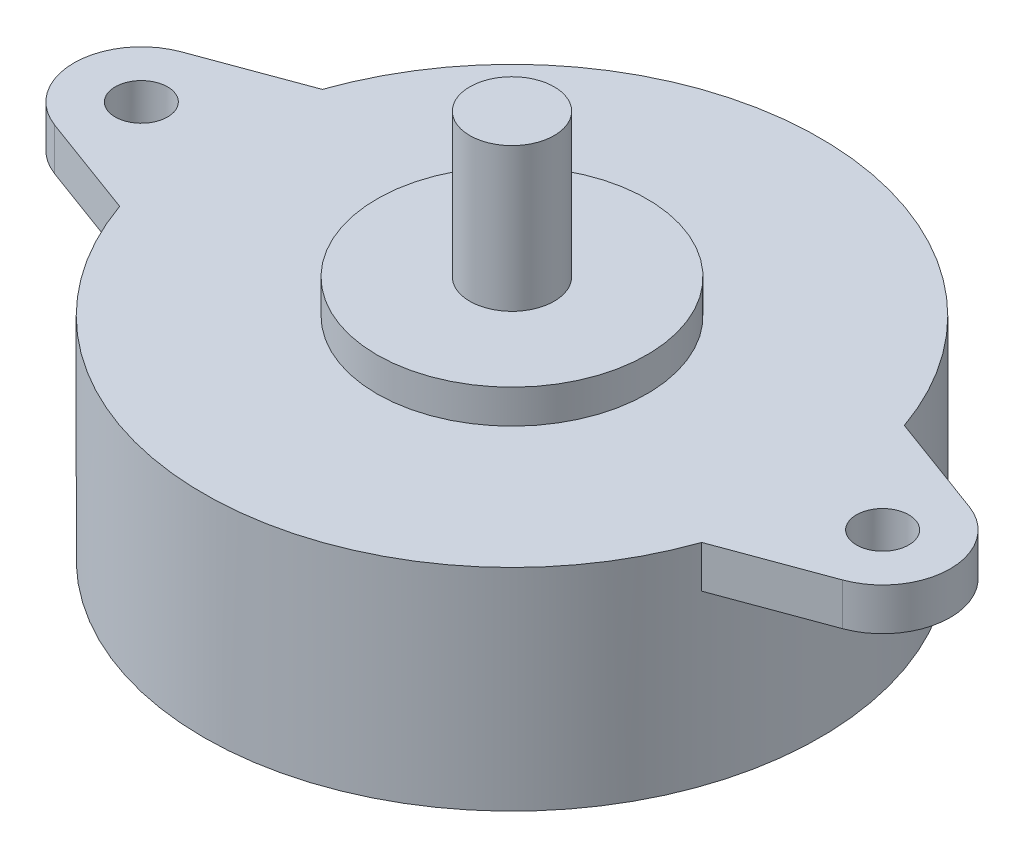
ISO-10303-21;
HEADER;
FILE_DESCRIPTION(('STEP AP214'),'2;1');
FILE_NAME('part.step','',(''),(''),'','','');
FILE_SCHEMA(('AUTOMOTIVE_DESIGN { 1 0 10303 214 1 1 1 1 }'));
ENDSEC;
DATA;
#1=APPLICATION_CONTEXT('core data for automotive mechanical design processes');
#2=APPLICATION_PROTOCOL_DEFINITION('international standard','automotive_design',2000,#1);
#3=PRODUCT_CONTEXT('',#1,'mechanical');
#4=PRODUCT('Part','Part','',(#3));
#5=PRODUCT_RELATED_PRODUCT_CATEGORY('part','',(#4));
#6=PRODUCT_DEFINITION_FORMATION('','',#4);
#7=PRODUCT_DEFINITION_CONTEXT('part definition',#1,'design');
#8=PRODUCT_DEFINITION('design','',#6,#7);
#9=PRODUCT_DEFINITION_SHAPE('','',#8);
#10=(LENGTH_UNIT() NAMED_UNIT(*) SI_UNIT(.MILLI.,.METRE.));
#11=(NAMED_UNIT(*) PLANE_ANGLE_UNIT() SI_UNIT($,.RADIAN.));
#12=(NAMED_UNIT(*) SI_UNIT($,.STERADIAN.) SOLID_ANGLE_UNIT());
#13=UNCERTAINTY_MEASURE_WITH_UNIT(LENGTH_MEASURE(1.E-05),#10,'distance_accuracy_value','');
#14=(GEOMETRIC_REPRESENTATION_CONTEXT(3) GLOBAL_UNCERTAINTY_ASSIGNED_CONTEXT((#13)) GLOBAL_UNIT_ASSIGNED_CONTEXT((#10,
#11,#12)) REPRESENTATION_CONTEXT('',''));
#15=CARTESIAN_POINT('',(0.,0.,0.));
#16=DIRECTION('',(0.,0.,1.));
#17=DIRECTION('',(1.,0.,0.));
#18=AXIS2_PLACEMENT_3D('',#15,#16,#17);
#19=CARTESIAN_POINT('',(-21.95,12.5,0.));
#20=DIRECTION('',(0.,-1.,0.));
#21=DIRECTION('',(0.,0.,-1.));
#22=AXIS2_PLACEMENT_3D('',#19,#20,#21);
#23=CYLINDRICAL_SURFACE('',#22,4.);
#24=CARTESIAN_POINT('',(-21.95,10.,0.));
#25=DIRECTION('',(0.,-1.,0.));
#26=DIRECTION('',(0.,0.,-1.));
#27=AXIS2_PLACEMENT_3D('',#24,#25,#26);
#28=CIRCLE('',#27,4.);
#29=CARTESIAN_POINT('',(-23.3329549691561,10.,3.75332326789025));
#30=VERTEX_POINT('',#29);
#31=CARTESIAN_POINT('',(-23.3329549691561,10.,-3.75332326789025));
#32=VERTEX_POINT('',#31);
#33=EDGE_CURVE('E108',#30,#32,#28,.T.);
#34=ORIENTED_EDGE('',*,*,#33,.F.);
#35=DIRECTION('',(0.,-1.,0.));
#36=VECTOR('',#35,1.);
#37=CARTESIAN_POINT('',(-23.3329549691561,12.5,3.75332326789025));
#38=LINE('',#37,#36);
#39=CARTESIAN_POINT('',(-23.3329549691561,12.5,3.75332326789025));
#40=VERTEX_POINT('',#39);
#41=EDGE_CURVE('E41',#40,#30,#38,.T.);
#42=ORIENTED_EDGE('',*,*,#41,.F.);
#43=CARTESIAN_POINT('',(-21.95,12.5,0.));
#44=DIRECTION('',(0.,1.,0.));
#45=DIRECTION('',(0.,0.,1.));
#46=AXIS2_PLACEMENT_3D('',#43,#44,#45);
#47=CIRCLE('',#46,4.);
#48=CARTESIAN_POINT('',(-23.3329549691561,12.5,-3.75332326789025));
#49=VERTEX_POINT('',#48);
#50=EDGE_CURVE('E172',#49,#40,#47,.T.);
#51=ORIENTED_EDGE('',*,*,#50,.F.);
#52=DIRECTION('',(0.,-1.,0.));
#53=VECTOR('',#52,1.);
#54=CARTESIAN_POINT('',(-23.3329549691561,12.5,-3.75332326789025));
#55=LINE('',#54,#53);
#56=EDGE_CURVE('E130',#49,#32,#55,.T.);
#57=ORIENTED_EDGE('',*,*,#56,.T.);
#58=EDGE_LOOP('',(#34,#42,#51,#57));
#59=FACE_BOUND('',#58,.T.);
#60=ADVANCED_FACE('F33',(#59),#23,.T.);
#61=CARTESIAN_POINT('',(-23.3329549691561,12.5,3.75332326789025));
#62=DIRECTION('',(0.345738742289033,0.,-0.938330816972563));
#63=DIRECTION('',(-0.938330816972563,0.,-0.345738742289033));
#64=AXIS2_PLACEMENT_3D('',#61,#62,#63);
#65=PLANE('',#64);
#66=DIRECTION('',(-0.938330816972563,0.,-0.345738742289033));
#67=VECTOR('',#66,1.);
#68=CARTESIAN_POINT('',(-23.3329549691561,10.,3.75332326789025));
#69=LINE('',#68,#67);
#70=CARTESIAN_POINT('',(-17.2355011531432,10.,6.));
#71=VERTEX_POINT('',#70);
#72=EDGE_CURVE('E120',#71,#30,#69,.T.);
#73=ORIENTED_EDGE('',*,*,#72,.F.);
#74=DIRECTION('',(0.,-1.,0.));
#75=VECTOR('',#74,1.);
#76=CARTESIAN_POINT('',(-17.2355011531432,12.5,6.));
#77=LINE('',#76,#75);
#78=CARTESIAN_POINT('',(-17.2355011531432,12.5,6.));
#79=VERTEX_POINT('',#78);
#80=EDGE_CURVE('E138',#79,#71,#77,.T.);
#81=ORIENTED_EDGE('',*,*,#80,.F.);
#82=DIRECTION('',(0.938330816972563,0.,0.345738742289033));
#83=VECTOR('',#82,1.);
#84=CARTESIAN_POINT('',(-23.3329549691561,12.5,3.75332326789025));
#85=LINE('',#84,#83);
#86=EDGE_CURVE('E174',#40,#79,#85,.T.);
#87=ORIENTED_EDGE('',*,*,#86,.F.);
#88=ORIENTED_EDGE('',*,*,#41,.T.);
#89=EDGE_LOOP('',(#73,#81,#87,#88));
#90=FACE_BOUND('',#89,.T.);
#91=ADVANCED_FACE('F201',(#90),#65,.F.);
#92=CARTESIAN_POINT('',(17.2355011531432,12.5,6.));
#93=DIRECTION('',(-0.345738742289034,0.,-0.938330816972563));
#94=DIRECTION('',(-0.938330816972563,0.,0.345738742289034));
#95=AXIS2_PLACEMENT_3D('',#92,#93,#94);
#96=PLANE('',#95);
#97=DIRECTION('',(-0.938330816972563,0.,0.345738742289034));
#98=VECTOR('',#97,1.);
#99=CARTESIAN_POINT('',(17.2355011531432,10.,6.));
#100=LINE('',#99,#98);
#101=CARTESIAN_POINT('',(23.3329549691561,10.,3.75332326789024));
#102=VERTEX_POINT('',#101);
#103=CARTESIAN_POINT('',(17.2355011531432,10.,6.));
#104=VERTEX_POINT('',#103);
#105=EDGE_CURVE('E103',#102,#104,#100,.T.);
#106=ORIENTED_EDGE('',*,*,#105,.F.);
#107=DIRECTION('',(0.,-1.,0.));
#108=VECTOR('',#107,1.);
#109=CARTESIAN_POINT('',(23.3329549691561,12.5,3.75332326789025));
#110=LINE('',#109,#108);
#111=CARTESIAN_POINT('',(23.3329549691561,12.5,3.75332326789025));
#112=VERTEX_POINT('',#111);
#113=EDGE_CURVE('E127',#112,#102,#110,.T.);
#114=ORIENTED_EDGE('',*,*,#113,.F.);
#115=DIRECTION('',(0.938330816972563,0.,-0.345738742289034));
#116=VECTOR('',#115,1.);
#117=CARTESIAN_POINT('',(17.2355011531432,12.5,6.));
#118=LINE('',#117,#116);
#119=CARTESIAN_POINT('',(17.2355011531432,12.5,5.99999999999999));
#120=VERTEX_POINT('',#119);
#121=EDGE_CURVE('E178',#120,#112,#118,.T.);
#122=ORIENTED_EDGE('',*,*,#121,.F.);
#123=DIRECTION('',(0.,-1.,0.));
#124=VECTOR('',#123,1.);
#125=CARTESIAN_POINT('',(17.2355011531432,12.5,5.99999999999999));
#126=LINE('',#125,#124);
#127=EDGE_CURVE('E136',#120,#104,#126,.T.);
#128=ORIENTED_EDGE('',*,*,#127,.T.);
#129=EDGE_LOOP('',(#106,#114,#122,#128));
#130=FACE_BOUND('',#129,.T.);
#131=ADVANCED_FACE('F223',(#130),#96,.F.);
#132=CARTESIAN_POINT('',(21.95,12.5,0.));
#133=DIRECTION('',(0.,-1.,0.));
#134=DIRECTION('',(0.,0.,-1.));
#135=AXIS2_PLACEMENT_3D('',#132,#133,#134);
#136=CYLINDRICAL_SURFACE('',#135,4.);
#137=CARTESIAN_POINT('',(21.95,10.,0.));
#138=DIRECTION('',(0.,-1.,0.));
#139=DIRECTION('',(0.,0.,-1.));
#140=AXIS2_PLACEMENT_3D('',#137,#138,#139);
#141=CIRCLE('',#140,4.);
#142=CARTESIAN_POINT('',(23.3329549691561,10.,-3.75332326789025));
#143=VERTEX_POINT('',#142);
#144=EDGE_CURVE('E119',#143,#102,#141,.T.);
#145=ORIENTED_EDGE('',*,*,#144,.F.);
#146=DIRECTION('',(0.,-1.,0.));
#147=VECTOR('',#146,1.);
#148=CARTESIAN_POINT('',(23.3329549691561,12.5,-3.75332326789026));
#149=LINE('',#148,#147);
#150=CARTESIAN_POINT('',(23.3329549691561,12.5,-3.75332326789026));
#151=VERTEX_POINT('',#150);
#152=EDGE_CURVE('E118',#151,#143,#149,.T.);
#153=ORIENTED_EDGE('',*,*,#152,.F.);
#154=CARTESIAN_POINT('',(21.95,12.5,0.));
#155=DIRECTION('',(0.,1.,0.));
#156=DIRECTION('',(0.,0.,1.));
#157=AXIS2_PLACEMENT_3D('',#154,#155,#156);
#158=CIRCLE('',#157,4.);
#159=EDGE_CURVE('E180',#112,#151,#158,.T.);
#160=ORIENTED_EDGE('',*,*,#159,.F.);
#161=ORIENTED_EDGE('',*,*,#113,.T.);
#162=EDGE_LOOP('',(#145,#153,#160,#161));
#163=FACE_BOUND('',#162,.T.);
#164=ADVANCED_FACE('F227',(#163),#136,.T.);
#165=CARTESIAN_POINT('',(23.3329549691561,12.5,-3.75332326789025));
#166=DIRECTION('',(-0.345738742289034,0.,0.938330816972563));
#167=DIRECTION('',(0.938330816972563,0.,0.345738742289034));
#168=AXIS2_PLACEMENT_3D('',#165,#166,#167);
#169=PLANE('',#168);
#170=DIRECTION('',(0.938330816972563,0.,0.345738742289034));
#171=VECTOR('',#170,1.);
#172=CARTESIAN_POINT('',(23.3329549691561,10.,-3.75332326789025));
#173=LINE('',#172,#171);
#174=CARTESIAN_POINT('',(17.2355011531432,10.,-6.));
#175=VERTEX_POINT('',#174);
#176=EDGE_CURVE('E100',#175,#143,#173,.T.);
#177=ORIENTED_EDGE('',*,*,#176,.F.);
#178=DIRECTION('',(0.,-1.,0.));
#179=VECTOR('',#178,1.);
#180=CARTESIAN_POINT('',(17.2355011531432,12.5,-6.));
#181=LINE('',#180,#179);
#182=CARTESIAN_POINT('',(17.2355011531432,12.5,-6.));
#183=VERTEX_POINT('',#182);
#184=EDGE_CURVE('E116',#183,#175,#181,.T.);
#185=ORIENTED_EDGE('',*,*,#184,.F.);
#186=DIRECTION('',(-0.938330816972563,0.,-0.345738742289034));
#187=VECTOR('',#186,1.);
#188=CARTESIAN_POINT('',(23.3329549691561,12.5,-3.75332326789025));
#189=LINE('',#188,#187);
#190=EDGE_CURVE('E182',#151,#183,#189,.T.);
#191=ORIENTED_EDGE('',*,*,#190,.F.);
#192=ORIENTED_EDGE('',*,*,#152,.T.);
#193=EDGE_LOOP('',(#177,#185,#191,#192));
#194=FACE_BOUND('',#193,.T.);
#195=ADVANCED_FACE('F114',(#194),#169,.F.);
#196=CARTESIAN_POINT('',(-17.2355011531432,12.5,-6.));
#197=DIRECTION('',(0.345738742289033,0.,0.938330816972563));
#198=DIRECTION('',(0.938330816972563,0.,-0.345738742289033));
#199=AXIS2_PLACEMENT_3D('',#196,#197,#198);
#200=PLANE('',#199);
#201=DIRECTION('',(0.938330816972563,0.,-0.345738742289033));
#202=VECTOR('',#201,1.);
#203=CARTESIAN_POINT('',(-17.2355011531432,10.,-6.));
#204=LINE('',#203,#202);
#205=CARTESIAN_POINT('',(-17.2355011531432,10.,-6.));
#206=VERTEX_POINT('',#205);
#207=EDGE_CURVE('E11',#32,#206,#204,.T.);
#208=ORIENTED_EDGE('',*,*,#207,.F.);
#209=ORIENTED_EDGE('',*,*,#56,.F.);
#210=DIRECTION('',(-0.938330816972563,0.,0.345738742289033));
#211=VECTOR('',#210,1.);
#212=CARTESIAN_POINT('',(-17.2355011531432,12.5,-6.));
#213=LINE('',#212,#211);
#214=CARTESIAN_POINT('',(-17.2355011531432,12.5,-6.));
#215=VERTEX_POINT('',#214);
#216=EDGE_CURVE('E49',#215,#49,#213,.T.);
#217=ORIENTED_EDGE('',*,*,#216,.F.);
#218=DIRECTION('',(0.,-1.,0.));
#219=VECTOR('',#218,1.);
#220=CARTESIAN_POINT('',(-17.2355011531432,12.5,-6.));
#221=LINE('',#220,#219);
#222=EDGE_CURVE('E125',#215,#206,#221,.T.);
#223=ORIENTED_EDGE('',*,*,#222,.T.);
#224=EDGE_LOOP('',(#208,#209,#217,#223));
#225=FACE_BOUND('',#224,.T.);
#226=ADVANCED_FACE('F194',(#225),#200,.F.);
#227=CARTESIAN_POINT('',(-21.95,0.,0.));
#228=DIRECTION('',(0.,1.,0.));
#229=DIRECTION('',(0.,0.,1.));
#230=AXIS2_PLACEMENT_3D('',#227,#228,#229);
#231=PLANE('',#230);
#232=CARTESIAN_POINT('',(0.,0.,0.));
#233=DIRECTION('',(0.,1.,0.));
#234=DIRECTION('',(0.,0.,1.));
#235=AXIS2_PLACEMENT_3D('',#232,#233,#234);
#236=CIRCLE('',#235,18.25);
#237=CARTESIAN_POINT('',(0.,0.,18.25));
#238=VERTEX_POINT('',#237);
#239=EDGE_CURVE('E169',#238,#238,#236,.T.);
#240=ORIENTED_EDGE('',*,*,#239,.F.);
#241=EDGE_LOOP('',(#240));
#242=FACE_BOUND('',#241,.T.);
#243=ADVANCED_FACE('F214',(#242),#231,.F.);
#244=CARTESIAN_POINT('',(0.,12.5,0.));
#245=DIRECTION('',(0.,-1.,0.));
#246=DIRECTION('',(0.,0.,-1.));
#247=AXIS2_PLACEMENT_3D('',#244,#245,#246);
#248=CYLINDRICAL_SURFACE('',#247,18.25);
#249=ORIENTED_EDGE('',*,*,#80,.T.);
#250=CARTESIAN_POINT('',(0.,10.,0.));
#251=DIRECTION('',(0.,-1.,0.));
#252=DIRECTION('',(0.,0.,-1.));
#253=AXIS2_PLACEMENT_3D('',#250,#251,#252);
#254=CIRCLE('',#253,18.25);
#255=EDGE_CURVE('E109',#71,#206,#254,.T.);
#256=ORIENTED_EDGE('',*,*,#255,.T.);
#257=ORIENTED_EDGE('',*,*,#222,.F.);
#258=CARTESIAN_POINT('',(0.,12.5,0.));
#259=DIRECTION('',(0.,1.,0.));
#260=DIRECTION('',(0.,0.,1.));
#261=AXIS2_PLACEMENT_3D('',#258,#259,#260);
#262=CIRCLE('',#261,18.25);
#263=EDGE_CURVE('E54',#183,#215,#262,.T.);
#264=ORIENTED_EDGE('',*,*,#263,.F.);
#265=ORIENTED_EDGE('',*,*,#184,.T.);
#266=EDGE_CURVE('E97',#175,#104,#254,.T.);
#267=ORIENTED_EDGE('',*,*,#266,.T.);
#268=ORIENTED_EDGE('',*,*,#127,.F.);
#269=CARTESIAN_POINT('',(0.,12.5,0.));
#270=DIRECTION('',(0.,1.,0.));
#271=DIRECTION('',(0.,0.,1.));
#272=AXIS2_PLACEMENT_3D('',#269,#270,#271);
#273=CIRCLE('',#272,18.25);
#274=EDGE_CURVE('E176',#79,#120,#273,.T.);
#275=ORIENTED_EDGE('',*,*,#274,.F.);
#276=EDGE_LOOP('',(#249,#256,#257,#264,#265,#267,#268,#275));
#277=FACE_BOUND('',#276,.T.);
#278=ORIENTED_EDGE('',*,*,#239,.T.);
#279=EDGE_LOOP('',(#278));
#280=FACE_BOUND('',#279,.T.);
#281=ADVANCED_FACE('F123',(#277,#280),#248,.T.);
#282=CARTESIAN_POINT('',(-21.95,12.5,0.));
#283=DIRECTION('',(0.,1.,0.));
#284=DIRECTION('',(0.,0.,1.));
#285=AXIS2_PLACEMENT_3D('',#282,#283,#284);
#286=PLANE('',#285);
#287=CARTESIAN_POINT('',(21.95,12.5,0.));
#288=DIRECTION('',(0.,1.,0.));
#289=DIRECTION('',(0.,0.,1.));
#290=AXIS2_PLACEMENT_3D('',#287,#288,#289);
#291=CIRCLE('',#290,1.55);
#292=CARTESIAN_POINT('',(21.95,12.5,1.54999999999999));
#293=VERTEX_POINT('',#292);
#294=EDGE_CURVE('E152',#293,#293,#291,.T.);
#295=ORIENTED_EDGE('',*,*,#294,.F.);
#296=EDGE_LOOP('',(#295));
#297=FACE_BOUND('',#296,.T.);
#298=CARTESIAN_POINT('',(-21.95,12.5,0.));
#299=DIRECTION('',(0.,1.,0.));
#300=DIRECTION('',(0.,0.,1.));
#301=AXIS2_PLACEMENT_3D('',#298,#299,#300);
#302=CIRCLE('',#301,1.55);
#303=CARTESIAN_POINT('',(-21.95,12.5,1.55));
#304=VERTEX_POINT('',#303);
#305=EDGE_CURVE('E143',#304,#304,#302,.T.);
#306=ORIENTED_EDGE('',*,*,#305,.F.);
#307=EDGE_LOOP('',(#306));
#308=FACE_BOUND('',#307,.T.);
#309=CARTESIAN_POINT('',(0.,12.5,0.));
#310=DIRECTION('',(0.,1.,0.));
#311=DIRECTION('',(0.,0.,1.));
#312=AXIS2_PLACEMENT_3D('',#309,#310,#311);
#313=CIRCLE('',#312,8.);
#314=CARTESIAN_POINT('',(0.,12.5,8.));
#315=VERTEX_POINT('',#314);
#316=EDGE_CURVE('E163',#315,#315,#313,.T.);
#317=ORIENTED_EDGE('',*,*,#316,.F.);
#318=EDGE_LOOP('',(#317));
#319=FACE_BOUND('',#318,.T.);
#320=ORIENTED_EDGE('',*,*,#50,.T.);
#321=ORIENTED_EDGE('',*,*,#86,.T.);
#322=ORIENTED_EDGE('',*,*,#274,.T.);
#323=ORIENTED_EDGE('',*,*,#121,.T.);
#324=ORIENTED_EDGE('',*,*,#159,.T.);
#325=ORIENTED_EDGE('',*,*,#190,.T.);
#326=ORIENTED_EDGE('',*,*,#263,.T.);
#327=ORIENTED_EDGE('',*,*,#216,.T.);
#328=EDGE_LOOP('',(#320,#321,#322,#323,#324,#325,#326,#327));
#329=FACE_BOUND('',#328,.T.);
#330=ADVANCED_FACE('F202',(#297,#308,#319,#329),#286,.T.);
#331=CARTESIAN_POINT('',(0.,14.5,0.));
#332=DIRECTION('',(0.,-1.,0.));
#333=DIRECTION('',(0.,0.,-1.));
#334=AXIS2_PLACEMENT_3D('',#331,#332,#333);
#335=CYLINDRICAL_SURFACE('',#334,8.);
#336=CARTESIAN_POINT('',(0.,14.5,0.));
#337=DIRECTION('',(0.,1.,0.));
#338=DIRECTION('',(0.,0.,1.));
#339=AXIS2_PLACEMENT_3D('',#336,#337,#338);
#340=CIRCLE('',#339,8.);
#341=CARTESIAN_POINT('',(0.,14.5,8.));
#342=VERTEX_POINT('',#341);
#343=EDGE_CURVE('E166',#342,#342,#340,.T.);
#344=ORIENTED_EDGE('',*,*,#343,.F.);
#345=EDGE_LOOP('',(#344));
#346=FACE_BOUND('',#345,.T.);
#347=ORIENTED_EDGE('',*,*,#316,.T.);
#348=EDGE_LOOP('',(#347));
#349=FACE_BOUND('',#348,.T.);
#350=ADVANCED_FACE('F204',(#346,#349),#335,.T.);
#351=CARTESIAN_POINT('',(0.,14.5,0.));
#352=DIRECTION('',(0.,1.,0.));
#353=DIRECTION('',(0.,0.,1.));
#354=AXIS2_PLACEMENT_3D('',#351,#352,#353);
#355=PLANE('',#354);
#356=CARTESIAN_POINT('',(0.,14.5,0.));
#357=DIRECTION('',(0.,1.,0.));
#358=DIRECTION('',(0.,0.,1.));
#359=AXIS2_PLACEMENT_3D('',#356,#357,#358);
#360=CIRCLE('',#359,2.5);
#361=CARTESIAN_POINT('',(0.,14.5,2.5));
#362=VERTEX_POINT('',#361);
#363=EDGE_CURVE('E159',#362,#362,#360,.T.);
#364=ORIENTED_EDGE('',*,*,#363,.F.);
#365=EDGE_LOOP('',(#364));
#366=FACE_BOUND('',#365,.T.);
#367=ORIENTED_EDGE('',*,*,#343,.T.);
#368=EDGE_LOOP('',(#367));
#369=FACE_BOUND('',#368,.T.);
#370=ADVANCED_FACE('F211',(#366,#369),#355,.T.);
#371=CARTESIAN_POINT('',(0.,23.,0.));
#372=DIRECTION('',(0.,-1.,0.));
#373=DIRECTION('',(0.,0.,-1.));
#374=AXIS2_PLACEMENT_3D('',#371,#372,#373);
#375=CYLINDRICAL_SURFACE('',#374,2.5);
#376=CARTESIAN_POINT('',(0.,23.,0.));
#377=DIRECTION('',(0.,1.,0.));
#378=DIRECTION('',(0.,0.,1.));
#379=AXIS2_PLACEMENT_3D('',#376,#377,#378);
#380=CIRCLE('',#379,2.5);
#381=CARTESIAN_POINT('',(0.,23.,2.5));
#382=VERTEX_POINT('',#381);
#383=EDGE_CURVE('E160',#382,#382,#380,.T.);
#384=ORIENTED_EDGE('',*,*,#383,.F.);
#385=EDGE_LOOP('',(#384));
#386=FACE_BOUND('',#385,.T.);
#387=ORIENTED_EDGE('',*,*,#363,.T.);
#388=EDGE_LOOP('',(#387));
#389=FACE_BOUND('',#388,.T.);
#390=ADVANCED_FACE('F300',(#386,#389),#375,.T.);
#391=CARTESIAN_POINT('',(0.,23.,0.));
#392=DIRECTION('',(0.,1.,0.));
#393=DIRECTION('',(0.,0.,1.));
#394=AXIS2_PLACEMENT_3D('',#391,#392,#393);
#395=PLANE('',#394);
#396=ORIENTED_EDGE('',*,*,#383,.T.);
#397=EDGE_LOOP('',(#396));
#398=FACE_BOUND('',#397,.T.);
#399=ADVANCED_FACE('F264',(#398),#395,.T.);
#400=CARTESIAN_POINT('',(0.,10.,0.));
#401=DIRECTION('',(0.,-1.,0.));
#402=DIRECTION('',(0.,0.,-1.));
#403=AXIS2_PLACEMENT_3D('',#400,#401,#402);
#404=PLANE('',#403);
#405=CARTESIAN_POINT('',(-21.95,10.,0.));
#406=DIRECTION('',(0.,-1.,0.));
#407=DIRECTION('',(0.,0.,-1.));
#408=AXIS2_PLACEMENT_3D('',#405,#406,#407);
#409=CIRCLE('',#408,1.55);
#410=CARTESIAN_POINT('',(-21.95,10.,-1.55));
#411=VERTEX_POINT('',#410);
#412=EDGE_CURVE('E141',#411,#411,#409,.T.);
#413=ORIENTED_EDGE('',*,*,#412,.F.);
#414=EDGE_LOOP('',(#413));
#415=FACE_BOUND('',#414,.T.);
#416=ORIENTED_EDGE('',*,*,#72,.T.);
#417=ORIENTED_EDGE('',*,*,#33,.T.);
#418=ORIENTED_EDGE('',*,*,#207,.T.);
#419=ORIENTED_EDGE('',*,*,#255,.F.);
#420=EDGE_LOOP('',(#416,#417,#418,#419));
#421=FACE_BOUND('',#420,.T.);
#422=ADVANCED_FACE('F196',(#415,#421),#404,.T.);
#423=CARTESIAN_POINT('',(21.95,10.,0.));
#424=DIRECTION('',(0.,-1.,0.));
#425=DIRECTION('',(0.,0.,-1.));
#426=AXIS2_PLACEMENT_3D('',#423,#424,#425);
#427=CIRCLE('',#426,1.55);
#428=CARTESIAN_POINT('',(21.95,10.,-1.55000000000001));
#429=VERTEX_POINT('',#428);
#430=EDGE_CURVE('E36',#429,#429,#427,.T.);
#431=ORIENTED_EDGE('',*,*,#430,.F.);
#432=EDGE_LOOP('',(#431));
#433=FACE_BOUND('',#432,.T.);
#434=ORIENTED_EDGE('',*,*,#105,.T.);
#435=ORIENTED_EDGE('',*,*,#266,.F.);
#436=ORIENTED_EDGE('',*,*,#176,.T.);
#437=ORIENTED_EDGE('',*,*,#144,.T.);
#438=EDGE_LOOP('',(#434,#435,#436,#437));
#439=FACE_BOUND('',#438,.T.);
#440=ADVANCED_FACE('F99',(#433,#439),#404,.T.);
#441=CARTESIAN_POINT('',(-21.95,2.5,0.));
#442=DIRECTION('',(0.,1.,0.));
#443=DIRECTION('',(0.,0.,1.));
#444=AXIS2_PLACEMENT_3D('',#441,#442,#443);
#445=CYLINDRICAL_SURFACE('',#444,1.55);
#446=ORIENTED_EDGE('',*,*,#412,.T.);
#447=EDGE_LOOP('',(#446));
#448=FACE_BOUND('',#447,.T.);
#449=ORIENTED_EDGE('',*,*,#305,.T.);
#450=EDGE_LOOP('',(#449));
#451=FACE_BOUND('',#450,.T.);
#452=ADVANCED_FACE('F275',(#448,#451),#445,.F.);
#453=CARTESIAN_POINT('',(21.95,2.5,0.));
#454=DIRECTION('',(0.,1.,0.));
#455=DIRECTION('',(0.,0.,1.));
#456=AXIS2_PLACEMENT_3D('',#453,#454,#455);
#457=CYLINDRICAL_SURFACE('',#456,1.55);
#458=ORIENTED_EDGE('',*,*,#430,.T.);
#459=EDGE_LOOP('',(#458));
#460=FACE_BOUND('',#459,.T.);
#461=ORIENTED_EDGE('',*,*,#294,.T.);
#462=EDGE_LOOP('',(#461));
#463=FACE_BOUND('',#462,.T.);
#464=ADVANCED_FACE('F284',(#460,#463),#457,.F.);
#465=CLOSED_SHELL('',(#60,#91,#131,#164,#195,#226,#243,#281,#330,#350,#370,#390,#399,#422,#440,
#452,#464));
#466=MANIFOLD_SOLID_BREP('B2',#465);
#467=ADVANCED_BREP_SHAPE_REPRESENTATION('',(#18,#466),#14);
#468=SHAPE_DEFINITION_REPRESENTATION(#9,#467);
ENDSEC;
END-ISO-10303-21;
